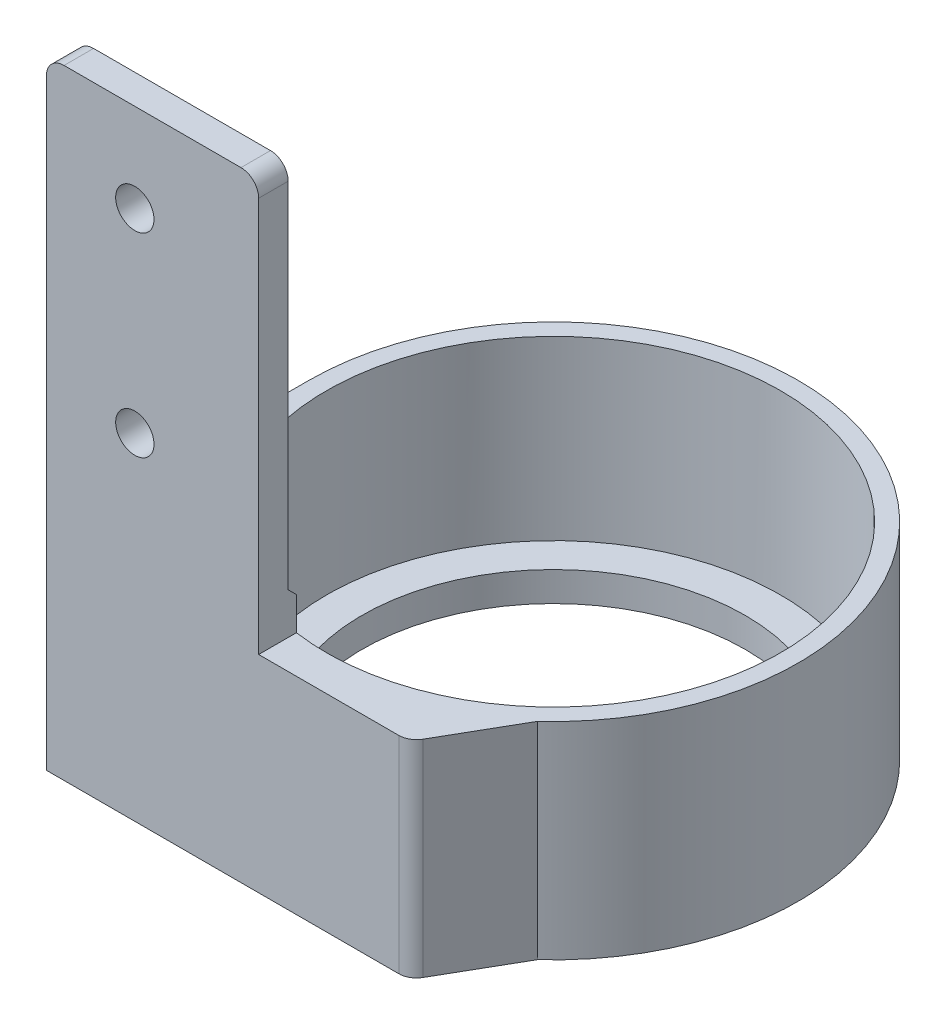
ISO-10303-21;
HEADER;
FILE_DESCRIPTION(('STEP AP214'),'2;1');
FILE_NAME('part.step','',(''),(''),'','','');
FILE_SCHEMA(('AUTOMOTIVE_DESIGN { 1 0 10303 214 1 1 1 1 }'));
ENDSEC;
DATA;
#1=APPLICATION_CONTEXT('core data for automotive mechanical design processes');
#2=APPLICATION_PROTOCOL_DEFINITION('international standard','automotive_design',2000,#1);
#3=PRODUCT_CONTEXT('',#1,'mechanical');
#4=PRODUCT('Part','Part','',(#3));
#5=PRODUCT_RELATED_PRODUCT_CATEGORY('part','',(#4));
#6=PRODUCT_DEFINITION_FORMATION('','',#4);
#7=PRODUCT_DEFINITION_CONTEXT('part definition',#1,'design');
#8=PRODUCT_DEFINITION('design','',#6,#7);
#9=PRODUCT_DEFINITION_SHAPE('','',#8);
#10=(LENGTH_UNIT() NAMED_UNIT(*) SI_UNIT(.MILLI.,.METRE.));
#11=(NAMED_UNIT(*) PLANE_ANGLE_UNIT() SI_UNIT($,.RADIAN.));
#12=(NAMED_UNIT(*) SI_UNIT($,.STERADIAN.) SOLID_ANGLE_UNIT());
#13=UNCERTAINTY_MEASURE_WITH_UNIT(LENGTH_MEASURE(1.E-05),#10,'distance_accuracy_value','');
#14=(GEOMETRIC_REPRESENTATION_CONTEXT(3) GLOBAL_UNCERTAINTY_ASSIGNED_CONTEXT((#13)) GLOBAL_UNIT_ASSIGNED_CONTEXT((#10,
#11,#12)) REPRESENTATION_CONTEXT('',''));
#15=CARTESIAN_POINT('',(0.,0.,0.));
#16=DIRECTION('',(0.,0.,1.));
#17=DIRECTION('',(1.,0.,0.));
#18=AXIS2_PLACEMENT_3D('',#15,#16,#17);
#19=CARTESIAN_POINT('',(36.,-3.00000000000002,7.));
#20=DIRECTION('',(-1.,0.,0.));
#21=DIRECTION('',(0.,-1.,0.));
#22=AXIS2_PLACEMENT_3D('',#19,#20,#21);
#23=PLANE('',#22);
#24=DIRECTION('',(0.,-1.,0.));
#25=VECTOR('',#24,1.);
#26=CARTESIAN_POINT('',(36.,-60.,3.60511776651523));
#27=LINE('',#26,#25);
#28=CARTESIAN_POINT('',(36.,-70.,3.60511776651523));
#29=VERTEX_POINT('',#28);
#30=CARTESIAN_POINT('',(36.,-64.3948822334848,3.60511776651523));
#31=VERTEX_POINT('',#30);
#32=EDGE_CURVE('E156',#29,#31,#27,.F.);
#33=ORIENTED_EDGE('',*,*,#32,.T.);
#34=DIRECTION('',(0.,0.707106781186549,0.707106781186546));
#35=VECTOR('',#34,1.);
#36=CARTESIAN_POINT('',(36.,-63.,5.));
#37=LINE('',#36,#35);
#38=CARTESIAN_POINT('',(36.,-63.,5.));
#39=VERTEX_POINT('',#38);
#40=EDGE_CURVE('E170',#31,#39,#37,.T.);
#41=ORIENTED_EDGE('',*,*,#40,.T.);
#42=DIRECTION('',(0.,1.,0.));
#43=VECTOR('',#42,1.);
#44=CARTESIAN_POINT('',(36.,-3.00000000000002,5.));
#45=LINE('',#44,#43);
#46=CARTESIAN_POINT('',(36.,-3.00000000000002,5.));
#47=VERTEX_POINT('',#46);
#48=EDGE_CURVE('E189',#39,#47,#45,.T.);
#49=ORIENTED_EDGE('',*,*,#48,.T.);
#50=DIRECTION('',(0.,0.,1.));
#51=VECTOR('',#50,1.);
#52=CARTESIAN_POINT('',(36.,-3.00000000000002,7.));
#53=LINE('',#52,#51);
#54=CARTESIAN_POINT('',(36.,-3.00000000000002,10.));
#55=VERTEX_POINT('',#54);
#56=EDGE_CURVE('E270',#47,#55,#53,.T.);
#57=ORIENTED_EDGE('',*,*,#56,.T.);
#58=DIRECTION('',(0.,1.,0.));
#59=VECTOR('',#58,1.);
#60=CARTESIAN_POINT('',(36.,-3.00000000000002,10.));
#61=LINE('',#60,#59);
#62=CARTESIAN_POINT('',(36.,-70.,10.));
#63=VERTEX_POINT('',#62);
#64=EDGE_CURVE('E159',#63,#55,#61,.T.);
#65=ORIENTED_EDGE('',*,*,#64,.F.);
#66=DIRECTION('',(0.,0.,1.));
#67=VECTOR('',#66,1.);
#68=CARTESIAN_POINT('',(36.,-70.,7.));
#69=LINE('',#68,#67);
#70=EDGE_CURVE('E145',#29,#63,#69,.T.);
#71=ORIENTED_EDGE('',*,*,#70,.F.);
#72=EDGE_LOOP('',(#33,#41,#49,#57,#65,#71));
#73=FACE_BOUND('',#72,.T.);
#74=ADVANCED_FACE('F52',(#73),#23,.F.);
#75=CARTESIAN_POINT('',(36.,-63.,5.));
#76=DIRECTION('',(0.,0.707106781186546,-0.707106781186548));
#77=DIRECTION('',(0.,-0.707106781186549,-0.707106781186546));
#78=AXIS2_PLACEMENT_3D('',#75,#76,#77);
#79=PLANE('',#78);
#80=DIRECTION('',(-1.,0.,0.));
#81=VECTOR('',#80,1.);
#82=CARTESIAN_POINT('',(36.,-70.,-2.));
#83=LINE('',#82,#81);
#84=CARTESIAN_POINT('',(20.8602325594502,-70.,-1.99999999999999));
#85=VERTEX_POINT('',#84);
#86=CARTESIAN_POINT('',(0.,-70.,-2.));
#87=VERTEX_POINT('',#86);
#88=EDGE_CURVE('E148',#85,#87,#83,.T.);
#89=ORIENTED_EDGE('',*,*,#88,.T.);
#90=DIRECTION('',(0.,0.707106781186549,0.707106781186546));
#91=VECTOR('',#90,1.);
#92=CARTESIAN_POINT('',(0.,-63.,5.));
#93=LINE('',#92,#91);
#94=CARTESIAN_POINT('',(0.,-63.,5.));
#95=VERTEX_POINT('',#94);
#96=EDGE_CURVE('E166',#87,#95,#93,.T.);
#97=ORIENTED_EDGE('',*,*,#96,.T.);
#98=DIRECTION('',(-1.,0.,0.));
#99=VECTOR('',#98,1.);
#100=CARTESIAN_POINT('',(36.,-63.,5.));
#101=LINE('',#100,#99);
#102=EDGE_CURVE('E175',#39,#95,#101,.T.);
#103=ORIENTED_EDGE('',*,*,#102,.F.);
#104=ORIENTED_EDGE('',*,*,#40,.F.);
#105=CARTESIAN_POINT('',(41.5000000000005,-102.5,-34.5));
#106=DIRECTION('',(0.,-0.707106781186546,0.707106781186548));
#107=DIRECTION('',(0.,-0.707106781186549,-0.707106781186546));
#108=AXIS2_PLACEMENT_3D('',#105,#106,#107);
#109=ELLIPSE('',#108,54.4472221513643,38.5);
#110=EDGE_CURVE('E12',#85,#31,#109,.F.);
#111=ORIENTED_EDGE('',*,*,#110,.F.);
#112=EDGE_LOOP('',(#89,#97,#103,#104,#111));
#113=FACE_BOUND('',#112,.T.);
#114=ADVANCED_FACE('F329',(#113),#79,.T.);
#115=CARTESIAN_POINT('',(41.5,-70.,-34.5));
#116=DIRECTION('',(0.,-1.,0.));
#117=DIRECTION('',(0.,0.,1.));
#118=AXIS2_PLACEMENT_3D('',#115,#116,#117);
#119=PLANE('',#118);
#120=CARTESIAN_POINT('',(41.5000000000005,-70.,-34.5));
#121=DIRECTION('',(0.,1.,0.));
#122=DIRECTION('',(0.,0.,1.));
#123=AXIS2_PLACEMENT_3D('',#120,#121,#122);
#124=CIRCLE('',#123,38.5);
#125=EDGE_CURVE('E141',#29,#85,#124,.T.);
#126=ORIENTED_EDGE('',*,*,#125,.F.);
#127=ORIENTED_EDGE('',*,*,#70,.T.);
#128=DIRECTION('',(1.,0.,0.));
#129=VECTOR('',#128,1.);
#130=CARTESIAN_POINT('',(36.,-70.,10.));
#131=LINE('',#130,#129);
#132=CARTESIAN_POINT('',(59.7647412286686,-70.,10.));
#133=VERTEX_POINT('',#132);
#134=EDGE_CURVE('E162',#63,#133,#131,.T.);
#135=ORIENTED_EDGE('',*,*,#134,.T.);
#136=CARTESIAN_POINT('',(59.7647412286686,-70.,7.));
#137=DIRECTION('',(0.,-1.,0.));
#138=DIRECTION('',(0.,0.,-1.));
#139=AXIS2_PLACEMENT_3D('',#136,#137,#138);
#140=CIRCLE('',#139,2.99999999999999);
#141=CARTESIAN_POINT('',(62.3652189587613,-70.,8.49583273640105));
#142=VERTEX_POINT('',#141);
#143=EDGE_CURVE('E208',#133,#142,#140,.F.);
#144=ORIENTED_EDGE('',*,*,#143,.T.);
#145=DIRECTION('',(-0.498610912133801,0.,0.866825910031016));
#146=VECTOR('',#145,1.);
#147=CARTESIAN_POINT('',(46.2103102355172,-69.9999999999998,36.5808447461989));
#148=LINE('',#147,#146);
#149=CARTESIAN_POINT('',(69.453110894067,-69.9999999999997,-3.82633717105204));
#150=VERTEX_POINT('',#149);
#151=EDGE_CURVE('E274',#150,#142,#148,.T.);
#152=ORIENTED_EDGE('',*,*,#151,.F.);
#153=CARTESIAN_POINT('',(41.5,-70.,-34.5));
#154=DIRECTION('',(0.,1.,0.));
#155=DIRECTION('',(0.,0.,1.));
#156=AXIS2_PLACEMENT_3D('',#153,#154,#155);
#157=CIRCLE('',#156,41.5);
#158=CARTESIAN_POINT('',(0.,-70.,-34.5000000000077));
#159=VERTEX_POINT('',#158);
#160=EDGE_CURVE('E61',#150,#159,#157,.T.);
#161=ORIENTED_EDGE('',*,*,#160,.T.);
#162=DIRECTION('',(0.,0.,1.));
#163=VECTOR('',#162,1.);
#164=CARTESIAN_POINT('',(0.,-70.,7.));
#165=LINE('',#164,#163);
#166=EDGE_CURVE('E74',#159,#87,#165,.T.);
#167=ORIENTED_EDGE('',*,*,#166,.T.);
#168=ORIENTED_EDGE('',*,*,#88,.F.);
#169=EDGE_LOOP('',(#126,#127,#135,#144,#152,#161,#167,#168));
#170=FACE_BOUND('',#169,.T.);
#171=ADVANCED_FACE('F143',(#170),#119,.F.);
#172=CARTESIAN_POINT('',(41.5,-105.,-34.5));
#173=DIRECTION('',(0.,-1.,0.));
#174=DIRECTION('',(0.,0.,1.));
#175=AXIS2_PLACEMENT_3D('',#172,#173,#174);
#176=PLANE('',#175);
#177=CARTESIAN_POINT('',(41.5000000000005,-105.,-34.5));
#178=DIRECTION('',(0.,-1.,0.));
#179=DIRECTION('',(0.,0.,-1.));
#180=AXIS2_PLACEMENT_3D('',#177,#178,#179);
#181=CIRCLE('',#180,32.5);
#182=CARTESIAN_POINT('',(41.5000000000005,-105.,-67.));
#183=VERTEX_POINT('',#182);
#184=EDGE_CURVE('E285',#183,#183,#181,.T.);
#185=ORIENTED_EDGE('',*,*,#184,.F.);
#186=EDGE_LOOP('',(#185));
#187=FACE_BOUND('',#186,.T.);
#188=CARTESIAN_POINT('',(59.7647412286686,-105.,7.));
#189=DIRECTION('',(0.,-1.,0.));
#190=DIRECTION('',(0.,0.,-1.));
#191=AXIS2_PLACEMENT_3D('',#188,#189,#190);
#192=CIRCLE('',#191,2.99999999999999);
#193=CARTESIAN_POINT('',(59.7647412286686,-105.,10.));
#194=VERTEX_POINT('',#193);
#195=CARTESIAN_POINT('',(62.3652189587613,-105.,8.49583273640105));
#196=VERTEX_POINT('',#195);
#197=EDGE_CURVE('E209',#194,#196,#192,.F.);
#198=ORIENTED_EDGE('',*,*,#197,.F.);
#199=DIRECTION('',(1.,0.,0.));
#200=VECTOR('',#199,1.);
#201=CARTESIAN_POINT('',(33.,-105.,10.));
#202=LINE('',#201,#200);
#203=CARTESIAN_POINT('',(0.,-105.,10.));
#204=VERTEX_POINT('',#203);
#205=EDGE_CURVE('E253',#204,#194,#202,.T.);
#206=ORIENTED_EDGE('',*,*,#205,.F.);
#207=DIRECTION('',(0.,0.,1.));
#208=VECTOR('',#207,1.);
#209=CARTESIAN_POINT('',(0.,-105.,7.));
#210=LINE('',#209,#208);
#211=CARTESIAN_POINT('',(0.,-105.,-34.5000000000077));
#212=VERTEX_POINT('',#211);
#213=EDGE_CURVE('E257',#212,#204,#210,.T.);
#214=ORIENTED_EDGE('',*,*,#213,.F.);
#215=CARTESIAN_POINT('',(41.5,-105.,-34.5));
#216=DIRECTION('',(0.,1.,0.));
#217=DIRECTION('',(0.,0.,1.));
#218=AXIS2_PLACEMENT_3D('',#215,#216,#217);
#219=CIRCLE('',#218,41.5);
#220=CARTESIAN_POINT('',(69.4531108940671,-105.,-3.82633717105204));
#221=VERTEX_POINT('',#220);
#222=EDGE_CURVE('E150',#221,#212,#219,.T.);
#223=ORIENTED_EDGE('',*,*,#222,.F.);
#224=DIRECTION('',(-0.498610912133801,0.,0.866825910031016));
#225=VECTOR('',#224,1.);
#226=CARTESIAN_POINT('',(46.2103102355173,-105.,36.5808447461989));
#227=LINE('',#226,#225);
#228=EDGE_CURVE('E273',#221,#196,#227,.T.);
#229=ORIENTED_EDGE('',*,*,#228,.T.);
#230=EDGE_LOOP('',(#198,#206,#214,#223,#229));
#231=FACE_BOUND('',#230,.T.);
#232=ADVANCED_FACE('F306',(#187,#231),#176,.T.);
#233=CARTESIAN_POINT('',(46.2103102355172,-69.9999999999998,36.5808447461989));
#234=DIRECTION('',(-0.866825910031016,0.,-0.498610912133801));
#235=DIRECTION('',(0.498610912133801,0.,-0.866825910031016));
#236=AXIS2_PLACEMENT_3D('',#233,#234,#235);
#237=PLANE('',#236);
#238=DIRECTION('',(0.,1.,0.));
#239=VECTOR('',#238,1.);
#240=CARTESIAN_POINT('',(62.3652189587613,-105.,8.49583273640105));
#241=LINE('',#240,#239);
#242=EDGE_CURVE('E217',#196,#142,#241,.T.);
#243=ORIENTED_EDGE('',*,*,#242,.F.);
#244=ORIENTED_EDGE('',*,*,#228,.F.);
#245=DIRECTION('',(0.,-1.,0.));
#246=VECTOR('',#245,1.);
#247=CARTESIAN_POINT('',(69.453110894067,-69.9999999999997,-3.82633717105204));
#248=LINE('',#247,#246);
#249=EDGE_CURVE('E278',#150,#221,#248,.T.);
#250=ORIENTED_EDGE('',*,*,#249,.F.);
#251=ORIENTED_EDGE('',*,*,#151,.T.);
#252=EDGE_LOOP('',(#243,#244,#250,#251));
#253=FACE_BOUND('',#252,.T.);
#254=ADVANCED_FACE('F314',(#253),#237,.F.);
#255=CARTESIAN_POINT('',(33.,-3.,10.));
#256=DIRECTION('',(0.,0.,1.));
#257=DIRECTION('',(-1.,0.,0.));
#258=AXIS2_PLACEMENT_3D('',#255,#256,#257);
#259=PLANE('',#258);
#260=CARTESIAN_POINT('',(15.,-15.,10.));
#261=DIRECTION('',(0.,0.,1.));
#262=DIRECTION('',(1.,0.,0.));
#263=AXIS2_PLACEMENT_3D('',#260,#261,#262);
#264=CIRCLE('',#263,3.25);
#265=CARTESIAN_POINT('',(18.25,-15.,10.));
#266=VERTEX_POINT('',#265);
#267=EDGE_CURVE('E232',#266,#266,#264,.T.);
#268=ORIENTED_EDGE('',*,*,#267,.F.);
#269=EDGE_LOOP('',(#268));
#270=FACE_BOUND('',#269,.T.);
#271=CARTESIAN_POINT('',(15.,-48.,10.));
#272=DIRECTION('',(0.,0.,1.));
#273=DIRECTION('',(1.,0.,0.));
#274=AXIS2_PLACEMENT_3D('',#271,#272,#273);
#275=CIRCLE('',#274,3.25000000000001);
#276=CARTESIAN_POINT('',(18.25,-48.,10.));
#277=VERTEX_POINT('',#276);
#278=EDGE_CURVE('E161',#277,#277,#275,.T.);
#279=ORIENTED_EDGE('',*,*,#278,.F.);
#280=EDGE_LOOP('',(#279));
#281=FACE_BOUND('',#280,.T.);
#282=ORIENTED_EDGE('',*,*,#134,.F.);
#283=ORIENTED_EDGE('',*,*,#64,.T.);
#284=CARTESIAN_POINT('',(33.,-3.,10.));
#285=DIRECTION('',(0.,0.,1.));
#286=DIRECTION('',(-1.,0.,0.));
#287=AXIS2_PLACEMENT_3D('',#284,#285,#286);
#288=CIRCLE('',#287,3.);
#289=CARTESIAN_POINT('',(33.,0.,10.));
#290=VERTEX_POINT('',#289);
#291=EDGE_CURVE('E238',#55,#290,#288,.T.);
#292=ORIENTED_EDGE('',*,*,#291,.T.);
#293=DIRECTION('',(-1.,0.,0.));
#294=VECTOR('',#293,1.);
#295=CARTESIAN_POINT('',(3.00000000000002,0.,10.));
#296=LINE('',#295,#294);
#297=CARTESIAN_POINT('',(3.00000000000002,0.,10.));
#298=VERTEX_POINT('',#297);
#299=EDGE_CURVE('E242',#290,#298,#296,.T.);
#300=ORIENTED_EDGE('',*,*,#299,.T.);
#301=CARTESIAN_POINT('',(3.,-3.,10.));
#302=DIRECTION('',(0.,0.,1.));
#303=DIRECTION('',(1.,0.,0.));
#304=AXIS2_PLACEMENT_3D('',#301,#302,#303);
#305=CIRCLE('',#304,3.);
#306=CARTESIAN_POINT('',(0.,-3.00000000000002,10.));
#307=VERTEX_POINT('',#306);
#308=EDGE_CURVE('E246',#298,#307,#305,.T.);
#309=ORIENTED_EDGE('',*,*,#308,.T.);
#310=DIRECTION('',(0.,-1.,0.));
#311=VECTOR('',#310,1.);
#312=CARTESIAN_POINT('',(0.,-97.,10.));
#313=LINE('',#312,#311);
#314=EDGE_CURVE('E250',#307,#204,#313,.T.);
#315=ORIENTED_EDGE('',*,*,#314,.T.);
#316=ORIENTED_EDGE('',*,*,#205,.T.);
#317=DIRECTION('',(0.,1.,0.));
#318=VECTOR('',#317,1.);
#319=CARTESIAN_POINT('',(59.7647412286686,-105.,10.));
#320=LINE('',#319,#318);
#321=EDGE_CURVE('E213',#194,#133,#320,.T.);
#322=ORIENTED_EDGE('',*,*,#321,.T.);
#323=EDGE_LOOP('',(#282,#283,#292,#300,#309,#315,#316,#322));
#324=FACE_BOUND('',#323,.T.);
#325=ADVANCED_FACE('F318',(#270,#281,#324),#259,.T.);
#326=CARTESIAN_POINT('',(41.5,-70.,-34.5));
#327=DIRECTION('',(0.,-1.,0.));
#328=DIRECTION('',(0.,0.,1.));
#329=AXIS2_PLACEMENT_3D('',#326,#327,#328);
#330=CYLINDRICAL_SURFACE('',#329,41.5);
#331=DIRECTION('',(0.,-1.,0.));
#332=VECTOR('',#331,1.);
#333=CARTESIAN_POINT('',(4.71844785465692E-13,-70.,-34.4999999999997));
#334=LINE('',#333,#332);
#335=EDGE_CURVE('E224',#159,#212,#334,.T.);
#336=ORIENTED_EDGE('',*,*,#335,.F.);
#337=ORIENTED_EDGE('',*,*,#160,.F.);
#338=ORIENTED_EDGE('',*,*,#249,.T.);
#339=ORIENTED_EDGE('',*,*,#222,.T.);
#340=EDGE_LOOP('',(#336,#337,#338,#339));
#341=FACE_BOUND('',#340,.T.);
#342=ADVANCED_FACE('F54',(#341),#330,.T.);
#343=CARTESIAN_POINT('',(41.5000000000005,0.,-34.5));
#344=DIRECTION('',(0.,-1.,0.));
#345=DIRECTION('',(0.,0.,1.));
#346=AXIS2_PLACEMENT_3D('',#343,#344,#345);
#347=CYLINDRICAL_SURFACE('',#346,38.5);
#348=CARTESIAN_POINT('',(41.5000000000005,-100.,-34.5));
#349=DIRECTION('',(0.,-1.,0.));
#350=DIRECTION('',(1.,0.,0.));
#351=AXIS2_PLACEMENT_3D('',#348,#349,#350);
#352=CIRCLE('',#351,38.5);
#353=CARTESIAN_POINT('',(80.0000000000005,-100.,-34.5));
#354=VERTEX_POINT('',#353);
#355=EDGE_CURVE('E151',#354,#354,#352,.T.);
#356=ORIENTED_EDGE('',*,*,#355,.T.);
#357=EDGE_LOOP('',(#356));
#358=FACE_BOUND('',#357,.T.);
#359=ORIENTED_EDGE('',*,*,#125,.T.);
#360=ORIENTED_EDGE('',*,*,#110,.T.);
#361=ORIENTED_EDGE('',*,*,#32,.F.);
#362=EDGE_LOOP('',(#359,#360,#361));
#363=FACE_BOUND('',#362,.T.);
#364=ADVANCED_FACE('F164',(#358,#363),#347,.F.);
#365=CARTESIAN_POINT('',(41.5000000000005,-100.,-34.5));
#366=DIRECTION('',(0.,1.,0.));
#367=DIRECTION('',(0.,0.,-1.));
#368=AXIS2_PLACEMENT_3D('',#365,#366,#367);
#369=PLANE('',#368);
#370=CARTESIAN_POINT('',(41.5000000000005,-100.,-34.5));
#371=DIRECTION('',(0.,-1.,0.));
#372=DIRECTION('',(0.,0.,-1.));
#373=AXIS2_PLACEMENT_3D('',#370,#371,#372);
#374=CIRCLE('',#373,32.5);
#375=CARTESIAN_POINT('',(41.5000000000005,-100.,-67.));
#376=VERTEX_POINT('',#375);
#377=EDGE_CURVE('E284',#376,#376,#374,.T.);
#378=ORIENTED_EDGE('',*,*,#377,.T.);
#379=EDGE_LOOP('',(#378));
#380=FACE_BOUND('',#379,.T.);
#381=ORIENTED_EDGE('',*,*,#355,.F.);
#382=EDGE_LOOP('',(#381));
#383=FACE_BOUND('',#382,.T.);
#384=ADVANCED_FACE('F356',(#380,#383),#369,.T.);
#385=CARTESIAN_POINT('',(41.5000000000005,-105.,-34.5));
#386=DIRECTION('',(0.,1.,0.));
#387=DIRECTION('',(0.,0.,-1.));
#388=AXIS2_PLACEMENT_3D('',#385,#386,#387);
#389=CYLINDRICAL_SURFACE('',#388,32.5);
#390=ORIENTED_EDGE('',*,*,#184,.T.);
#391=EDGE_LOOP('',(#390));
#392=FACE_BOUND('',#391,.T.);
#393=ORIENTED_EDGE('',*,*,#377,.F.);
#394=EDGE_LOOP('',(#393));
#395=FACE_BOUND('',#394,.T.);
#396=ADVANCED_FACE('F343',(#392,#395),#389,.F.);
#397=CARTESIAN_POINT('',(33.,-3.,7.));
#398=DIRECTION('',(0.,0.,1.));
#399=DIRECTION('',(-1.,0.,0.));
#400=AXIS2_PLACEMENT_3D('',#397,#398,#399);
#401=CYLINDRICAL_SURFACE('',#400,3.);
#402=ORIENTED_EDGE('',*,*,#291,.F.);
#403=ORIENTED_EDGE('',*,*,#56,.F.);
#404=CARTESIAN_POINT('',(33.,-3.,5.));
#405=DIRECTION('',(0.,0.,1.));
#406=DIRECTION('',(-1.,0.,0.));
#407=AXIS2_PLACEMENT_3D('',#404,#405,#406);
#408=CIRCLE('',#407,3.);
#409=CARTESIAN_POINT('',(33.,0.,5.));
#410=VERTEX_POINT('',#409);
#411=EDGE_CURVE('E193',#47,#410,#408,.T.);
#412=ORIENTED_EDGE('',*,*,#411,.T.);
#413=DIRECTION('',(0.,0.,1.));
#414=VECTOR('',#413,1.);
#415=CARTESIAN_POINT('',(33.,0.,7.));
#416=LINE('',#415,#414);
#417=EDGE_CURVE('E267',#410,#290,#416,.T.);
#418=ORIENTED_EDGE('',*,*,#417,.T.);
#419=EDGE_LOOP('',(#402,#403,#412,#418));
#420=FACE_BOUND('',#419,.T.);
#421=ADVANCED_FACE('F332',(#420),#401,.T.);
#422=CARTESIAN_POINT('',(3.00000000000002,0.,7.));
#423=DIRECTION('',(0.,-1.,0.));
#424=DIRECTION('',(0.,0.,1.));
#425=AXIS2_PLACEMENT_3D('',#422,#423,#424);
#426=PLANE('',#425);
#427=ORIENTED_EDGE('',*,*,#299,.F.);
#428=ORIENTED_EDGE('',*,*,#417,.F.);
#429=DIRECTION('',(-1.,0.,0.));
#430=VECTOR('',#429,1.);
#431=CARTESIAN_POINT('',(3.00000000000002,0.,5.));
#432=LINE('',#431,#430);
#433=CARTESIAN_POINT('',(3.00000000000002,0.,5.));
#434=VERTEX_POINT('',#433);
#435=EDGE_CURVE('E197',#410,#434,#432,.T.);
#436=ORIENTED_EDGE('',*,*,#435,.T.);
#437=DIRECTION('',(0.,0.,1.));
#438=VECTOR('',#437,1.);
#439=CARTESIAN_POINT('',(3.00000000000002,0.,7.));
#440=LINE('',#439,#438);
#441=EDGE_CURVE('E264',#434,#298,#440,.T.);
#442=ORIENTED_EDGE('',*,*,#441,.T.);
#443=EDGE_LOOP('',(#427,#428,#436,#442));
#444=FACE_BOUND('',#443,.T.);
#445=ADVANCED_FACE('F335',(#444),#426,.F.);
#446=CARTESIAN_POINT('',(3.,-3.,7.));
#447=DIRECTION('',(0.,0.,1.));
#448=DIRECTION('',(-1.,0.,0.));
#449=AXIS2_PLACEMENT_3D('',#446,#447,#448);
#450=CYLINDRICAL_SURFACE('',#449,3.);
#451=ORIENTED_EDGE('',*,*,#308,.F.);
#452=ORIENTED_EDGE('',*,*,#441,.F.);
#453=CARTESIAN_POINT('',(3.,-3.,5.));
#454=DIRECTION('',(0.,0.,1.));
#455=DIRECTION('',(1.,0.,0.));
#456=AXIS2_PLACEMENT_3D('',#453,#454,#455);
#457=CIRCLE('',#456,3.);
#458=CARTESIAN_POINT('',(0.,-3.00000000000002,5.));
#459=VERTEX_POINT('',#458);
#460=EDGE_CURVE('E201',#434,#459,#457,.T.);
#461=ORIENTED_EDGE('',*,*,#460,.T.);
#462=DIRECTION('',(0.,0.,1.));
#463=VECTOR('',#462,1.);
#464=CARTESIAN_POINT('',(0.,-3.00000000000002,7.));
#465=LINE('',#464,#463);
#466=EDGE_CURVE('E261',#459,#307,#465,.T.);
#467=ORIENTED_EDGE('',*,*,#466,.T.);
#468=EDGE_LOOP('',(#451,#452,#461,#467));
#469=FACE_BOUND('',#468,.T.);
#470=ADVANCED_FACE('F323',(#469),#450,.T.);
#471=CARTESIAN_POINT('',(0.,-97.,7.));
#472=DIRECTION('',(1.,0.,0.));
#473=DIRECTION('',(0.,1.,0.));
#474=AXIS2_PLACEMENT_3D('',#471,#472,#473);
#475=PLANE('',#474);
#476=ORIENTED_EDGE('',*,*,#166,.F.);
#477=ORIENTED_EDGE('',*,*,#335,.T.);
#478=ORIENTED_EDGE('',*,*,#213,.T.);
#479=ORIENTED_EDGE('',*,*,#314,.F.);
#480=ORIENTED_EDGE('',*,*,#466,.F.);
#481=DIRECTION('',(0.,-1.,0.));
#482=VECTOR('',#481,1.);
#483=CARTESIAN_POINT('',(0.,-3.00000000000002,5.));
#484=LINE('',#483,#482);
#485=EDGE_CURVE('E205',#459,#95,#484,.T.);
#486=ORIENTED_EDGE('',*,*,#485,.T.);
#487=ORIENTED_EDGE('',*,*,#96,.F.);
#488=EDGE_LOOP('',(#476,#477,#478,#479,#480,#486,#487));
#489=FACE_BOUND('',#488,.T.);
#490=ADVANCED_FACE('F309',(#489),#475,.F.);
#491=CARTESIAN_POINT('',(15.,-15.,7.));
#492=DIRECTION('',(0.,0.,1.));
#493=DIRECTION('',(-1.,0.,0.));
#494=AXIS2_PLACEMENT_3D('',#491,#492,#493);
#495=CYLINDRICAL_SURFACE('',#494,3.25);
#496=ORIENTED_EDGE('',*,*,#267,.T.);
#497=EDGE_LOOP('',(#496));
#498=FACE_BOUND('',#497,.T.);
#499=CARTESIAN_POINT('',(15.,-15.,5.));
#500=DIRECTION('',(0.,0.,1.));
#501=DIRECTION('',(1.,0.,0.));
#502=AXIS2_PLACEMENT_3D('',#499,#500,#501);
#503=CIRCLE('',#502,3.25);
#504=CARTESIAN_POINT('',(18.25,-15.,5.));
#505=VERTEX_POINT('',#504);
#506=EDGE_CURVE('E185',#505,#505,#503,.T.);
#507=ORIENTED_EDGE('',*,*,#506,.F.);
#508=EDGE_LOOP('',(#507));
#509=FACE_BOUND('',#508,.T.);
#510=ADVANCED_FACE('F446',(#498,#509),#495,.F.);
#511=CARTESIAN_POINT('',(15.,-48.,7.));
#512=DIRECTION('',(0.,0.,1.));
#513=DIRECTION('',(-1.,0.,0.));
#514=AXIS2_PLACEMENT_3D('',#511,#512,#513);
#515=CYLINDRICAL_SURFACE('',#514,3.25000000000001);
#516=ORIENTED_EDGE('',*,*,#278,.T.);
#517=EDGE_LOOP('',(#516));
#518=FACE_BOUND('',#517,.T.);
#519=CARTESIAN_POINT('',(15.,-48.,5.));
#520=DIRECTION('',(0.,0.,1.));
#521=DIRECTION('',(1.,0.,0.));
#522=AXIS2_PLACEMENT_3D('',#519,#520,#521);
#523=CIRCLE('',#522,3.25000000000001);
#524=CARTESIAN_POINT('',(18.25,-48.,5.));
#525=VERTEX_POINT('',#524);
#526=EDGE_CURVE('E179',#525,#525,#523,.T.);
#527=ORIENTED_EDGE('',*,*,#526,.F.);
#528=EDGE_LOOP('',(#527));
#529=FACE_BOUND('',#528,.T.);
#530=ADVANCED_FACE('F469',(#518,#529),#515,.F.);
#531=CARTESIAN_POINT('',(59.7647412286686,-105.,7.));
#532=DIRECTION('',(0.,1.,0.));
#533=DIRECTION('',(0.,0.,-1.));
#534=AXIS2_PLACEMENT_3D('',#531,#532,#533);
#535=CYLINDRICAL_SURFACE('',#534,2.99999999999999);
#536=ORIENTED_EDGE('',*,*,#143,.F.);
#537=ORIENTED_EDGE('',*,*,#321,.F.);
#538=ORIENTED_EDGE('',*,*,#197,.T.);
#539=ORIENTED_EDGE('',*,*,#242,.T.);
#540=EDGE_LOOP('',(#536,#537,#538,#539));
#541=FACE_BOUND('',#540,.T.);
#542=ADVANCED_FACE('F316',(#541),#535,.T.);
#543=CARTESIAN_POINT('',(3.,-3.,5.));
#544=DIRECTION('',(0.,0.,-1.));
#545=DIRECTION('',(1.,0.,0.));
#546=AXIS2_PLACEMENT_3D('',#543,#544,#545);
#547=PLANE('',#546);
#548=ORIENTED_EDGE('',*,*,#102,.T.);
#549=ORIENTED_EDGE('',*,*,#485,.F.);
#550=ORIENTED_EDGE('',*,*,#460,.F.);
#551=ORIENTED_EDGE('',*,*,#435,.F.);
#552=ORIENTED_EDGE('',*,*,#411,.F.);
#553=ORIENTED_EDGE('',*,*,#48,.F.);
#554=EDGE_LOOP('',(#548,#549,#550,#551,#552,#553));
#555=FACE_BOUND('',#554,.T.);
#556=ORIENTED_EDGE('',*,*,#506,.T.);
#557=EDGE_LOOP('',(#556));
#558=FACE_BOUND('',#557,.T.);
#559=ORIENTED_EDGE('',*,*,#526,.T.);
#560=EDGE_LOOP('',(#559));
#561=FACE_BOUND('',#560,.T.);
#562=ADVANCED_FACE('F326',(#555,#558,#561),#547,.T.);
#563=CLOSED_SHELL('',(#74,#114,#171,#232,#254,#325,#342,#364,#384,#396,#421,#445,#470,#490,#510,
#530,#542,#562));
#564=MANIFOLD_SOLID_BREP('B2',#563);
#565=ADVANCED_BREP_SHAPE_REPRESENTATION('',(#18,#564),#14);
#566=SHAPE_DEFINITION_REPRESENTATION(#9,#565);
ENDSEC;
END-ISO-10303-21;
